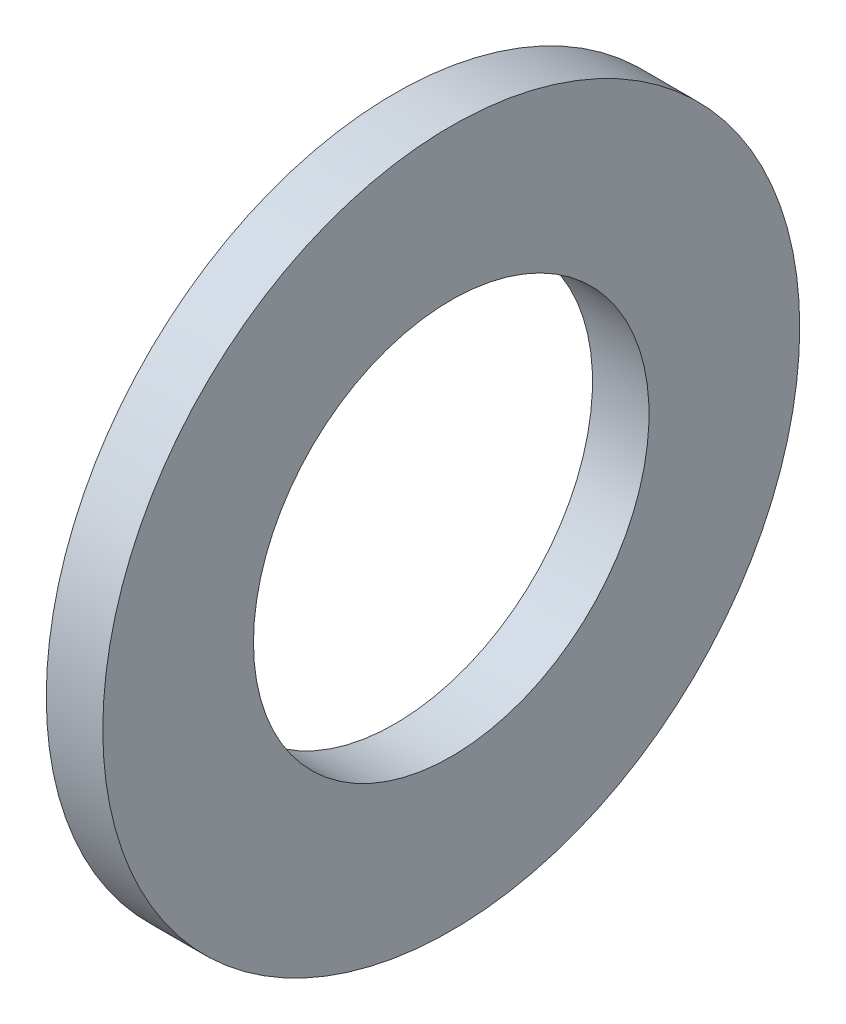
from build123d import *

# Parameters (mm, degrees)
SKETCH1_W = 3
SKETCH1_H = 8


with BuildPart() as part:
    # Sketch1 → Base-Revolve (revolve)
    with BuildSketch(Plane.XY, mode=Mode.PRIVATE) as base_revolve_sk:
        with Locations((-1.5, 14.5)):
            Rectangle(SKETCH1_W, SKETCH1_H)
    revolve(base_revolve_sk.sketch.rotate(Axis((-34.925, 0, 0), (1, 0, 0)), 90), axis=Axis((-34.925, 0, 0), (1, 0, 0)))


solid = part.part
